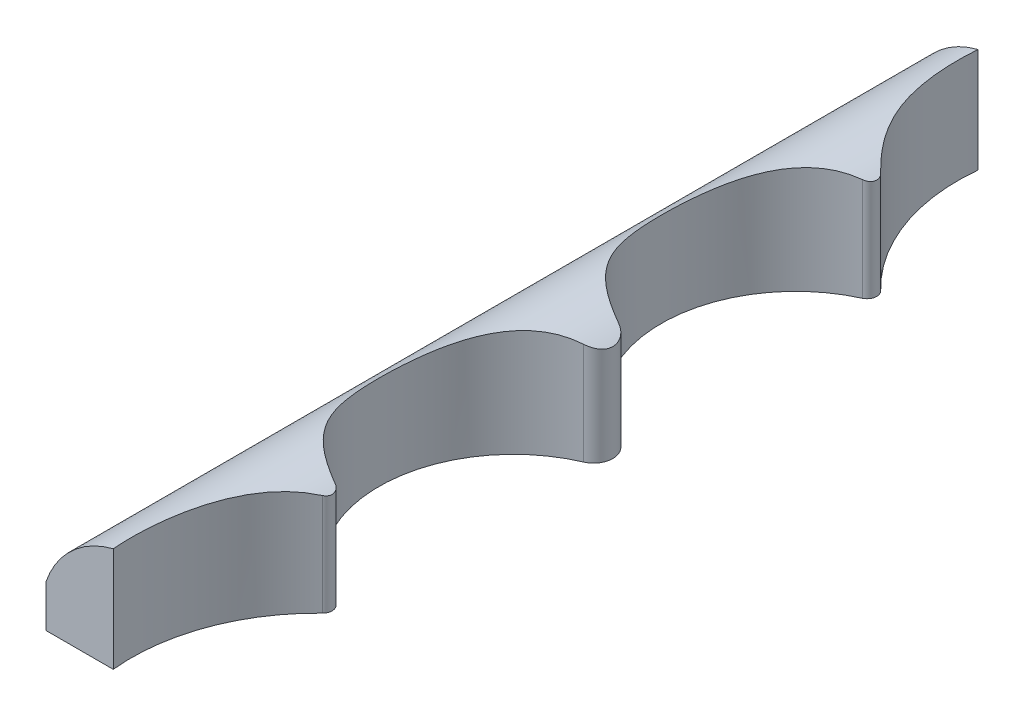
ISO-10303-21;
HEADER;
FILE_DESCRIPTION(('STEP AP214'),'2;1');
FILE_NAME('part.step','',(''),(''),'','','');
FILE_SCHEMA(('AUTOMOTIVE_DESIGN { 1 0 10303 214 1 1 1 1 }'));
ENDSEC;
DATA;
#1=APPLICATION_CONTEXT('core data for automotive mechanical design processes');
#2=APPLICATION_PROTOCOL_DEFINITION('international standard','automotive_design',2000,#1);
#3=PRODUCT_CONTEXT('',#1,'mechanical');
#4=PRODUCT('Part','Part','',(#3));
#5=PRODUCT_RELATED_PRODUCT_CATEGORY('part','',(#4));
#6=PRODUCT_DEFINITION_FORMATION('','',#4);
#7=PRODUCT_DEFINITION_CONTEXT('part definition',#1,'design');
#8=PRODUCT_DEFINITION('design','',#6,#7);
#9=PRODUCT_DEFINITION_SHAPE('','',#8);
#10=(LENGTH_UNIT() NAMED_UNIT(*) SI_UNIT(.MILLI.,.METRE.));
#11=(NAMED_UNIT(*) PLANE_ANGLE_UNIT() SI_UNIT($,.RADIAN.));
#12=(NAMED_UNIT(*) SI_UNIT($,.STERADIAN.) SOLID_ANGLE_UNIT());
#13=UNCERTAINTY_MEASURE_WITH_UNIT(LENGTH_MEASURE(1.E-05),#10,'distance_accuracy_value','');
#14=(GEOMETRIC_REPRESENTATION_CONTEXT(3) GLOBAL_UNCERTAINTY_ASSIGNED_CONTEXT((#13)) GLOBAL_UNIT_ASSIGNED_CONTEXT((#10,
#11,#12)) REPRESENTATION_CONTEXT('',''));
#15=CARTESIAN_POINT('',(0.,0.,0.));
#16=DIRECTION('',(0.,0.,1.));
#17=DIRECTION('',(1.,0.,0.));
#18=AXIS2_PLACEMENT_3D('',#15,#16,#17);
#19=CARTESIAN_POINT('',(-40.,35.,235.));
#20=DIRECTION('',(1.,0.,0.));
#21=DIRECTION('',(0.,1.,0.));
#22=AXIS2_PLACEMENT_3D('',#19,#20,#21);
#23=PLANE('',#22);
#24=DIRECTION('',(0.,1.,0.));
#25=VECTOR('',#24,1.);
#26=CARTESIAN_POINT('',(-40.,-35.,225.));
#27=LINE('',#26,#25);
#28=CARTESIAN_POINT('',(-40.,-35.,225.));
#29=VERTEX_POINT('',#28);
#30=CARTESIAN_POINT('',(-40.,-13.,225.));
#31=VERTEX_POINT('',#30);
#32=EDGE_CURVE('E130',#29,#31,#27,.T.);
#33=ORIENTED_EDGE('',*,*,#32,.T.);
#34=DIRECTION('',(0.,0.,1.));
#35=VECTOR('',#34,1.);
#36=CARTESIAN_POINT('',(-40.,-13.,-225.));
#37=LINE('',#36,#35);
#38=CARTESIAN_POINT('',(-40.,-13.,-225.));
#39=VERTEX_POINT('',#38);
#40=EDGE_CURVE('E115',#39,#31,#37,.T.);
#41=ORIENTED_EDGE('',*,*,#40,.F.);
#42=DIRECTION('',(0.,1.,0.));
#43=VECTOR('',#42,1.);
#44=CARTESIAN_POINT('',(-40.,-35.,-225.));
#45=LINE('',#44,#43);
#46=CARTESIAN_POINT('',(-40.,-35.,-225.));
#47=VERTEX_POINT('',#46);
#48=EDGE_CURVE('E128',#47,#39,#45,.T.);
#49=ORIENTED_EDGE('',*,*,#48,.F.);
#50=DIRECTION('',(0.,0.,-1.));
#51=VECTOR('',#50,1.);
#52=CARTESIAN_POINT('',(-40.,-35.,235.));
#53=LINE('',#52,#51);
#54=EDGE_CURVE('E46',#29,#47,#53,.T.);
#55=ORIENTED_EDGE('',*,*,#54,.F.);
#56=EDGE_LOOP('',(#33,#41,#49,#55));
#57=FACE_BOUND('',#56,.T.);
#58=ADVANCED_FACE('F34',(#57),#23,.F.);
#59=CARTESIAN_POINT('',(-40.,-35.,235.));
#60=DIRECTION('',(0.,1.,0.));
#61=DIRECTION('',(0.,0.,1.));
#62=AXIS2_PLACEMENT_3D('',#59,#60,#61);
#63=PLANE('',#62);
#64=DIRECTION('',(1.,0.,0.));
#65=VECTOR('',#64,1.);
#66=CARTESIAN_POINT('',(-40.,-35.,-225.));
#67=LINE('',#66,#65);
#68=CARTESIAN_POINT('',(-5.,-35.,-225.));
#69=VERTEX_POINT('',#68);
#70=EDGE_CURVE('E133',#47,#69,#67,.T.);
#71=ORIENTED_EDGE('',*,*,#70,.T.);
#72=CARTESIAN_POINT('',(91.5078845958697,-35.,-215.032658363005));
#73=DIRECTION('',(0.,1.,0.));
#74=DIRECTION('',(0.,0.,1.));
#75=AXIS2_PLACEMENT_3D('',#72,#73,#74);
#76=CIRCLE('',#75,97.0212331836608);
#77=CARTESIAN_POINT('',(24.0654509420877,-35.,-145.285702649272));
#78=VERTEX_POINT('',#77);
#79=EDGE_CURVE('E181',#69,#78,#76,.T.);
#80=ORIENTED_EDGE('',*,*,#79,.T.);
#81=CARTESIAN_POINT('',(20.5897976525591,-35.,-141.691285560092));
#82=DIRECTION('',(0.,-1.,0.));
#83=DIRECTION('',(0.,0.,-1.));
#84=AXIS2_PLACEMENT_3D('',#81,#82,#83);
#85=CIRCLE('',#84,5.);
#86=CARTESIAN_POINT('',(22.6640725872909,-35.,-137.141847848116));
#87=VERTEX_POINT('',#86);
#88=EDGE_CURVE('E178',#78,#87,#85,.T.);
#89=ORIENTED_EDGE('',*,*,#88,.T.);
#90=CARTESIAN_POINT('',(51.703921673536,-35.,-73.4497198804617));
#91=DIRECTION('',(0.,1.,0.));
#92=DIRECTION('',(0.,0.,1.));
#93=AXIS2_PLACEMENT_3D('',#90,#91,#92);
#94=CIRCLE('',#93,70.);
#95=CARTESIAN_POINT('',(23.962990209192,-35.,-9.18121498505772));
#96=VERTEX_POINT('',#95);
#97=EDGE_CURVE('E175',#87,#96,#94,.T.);
#98=ORIENTED_EDGE('',*,*,#97,.T.);
#99=CARTESIAN_POINT('',(20.,-35.,0.));
#100=DIRECTION('',(0.,-1.,0.));
#101=DIRECTION('',(0.,0.,1.));
#102=AXIS2_PLACEMENT_3D('',#99,#100,#101);
#103=CIRCLE('',#102,10.);
#104=CARTESIAN_POINT('',(23.962990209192,-35.,9.18121498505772));
#105=VERTEX_POINT('',#104);
#106=EDGE_CURVE('E172',#96,#105,#103,.T.);
#107=ORIENTED_EDGE('',*,*,#106,.T.);
#108=CARTESIAN_POINT('',(51.703921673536,-35.,73.4497198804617));
#109=DIRECTION('',(0.,1.,0.));
#110=DIRECTION('',(0.,0.,-1.));
#111=AXIS2_PLACEMENT_3D('',#108,#109,#110);
#112=CIRCLE('',#111,70.);
#113=CARTESIAN_POINT('',(22.6640725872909,-35.,137.141847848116));
#114=VERTEX_POINT('',#113);
#115=EDGE_CURVE('E169',#105,#114,#112,.T.);
#116=ORIENTED_EDGE('',*,*,#115,.T.);
#117=CARTESIAN_POINT('',(20.5897976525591,-35.,141.691285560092));
#118=DIRECTION('',(0.,-1.,0.));
#119=DIRECTION('',(0.,0.,-1.));
#120=AXIS2_PLACEMENT_3D('',#117,#118,#119);
#121=CIRCLE('',#120,5.);
#122=CARTESIAN_POINT('',(24.0654509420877,-35.,145.285702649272));
#123=VERTEX_POINT('',#122);
#124=EDGE_CURVE('E166',#114,#123,#121,.T.);
#125=ORIENTED_EDGE('',*,*,#124,.T.);
#126=CARTESIAN_POINT('',(91.5078845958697,-35.,215.032658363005));
#127=DIRECTION('',(0.,1.,0.));
#128=DIRECTION('',(0.,0.,-1.));
#129=AXIS2_PLACEMENT_3D('',#126,#127,#128);
#130=CIRCLE('',#129,97.0212331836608);
#131=CARTESIAN_POINT('',(-5.,-35.,225.));
#132=VERTEX_POINT('',#131);
#133=EDGE_CURVE('E145',#123,#132,#130,.T.);
#134=ORIENTED_EDGE('',*,*,#133,.T.);
#135=DIRECTION('',(-1.,0.,0.));
#136=VECTOR('',#135,1.);
#137=CARTESIAN_POINT('',(-40.,-35.,225.));
#138=LINE('',#137,#136);
#139=EDGE_CURVE('E138',#132,#29,#138,.T.);
#140=ORIENTED_EDGE('',*,*,#139,.T.);
#141=ORIENTED_EDGE('',*,*,#54,.T.);
#142=EDGE_LOOP('',(#71,#80,#89,#98,#107,#116,#125,#134,#140,#141));
#143=FACE_BOUND('',#142,.T.);
#144=ADVANCED_FACE('F254',(#143),#63,.F.);
#145=CARTESIAN_POINT('',(-40.,-35.,-225.));
#146=DIRECTION('',(0.,0.,1.));
#147=DIRECTION('',(1.,0.,0.));
#148=AXIS2_PLACEMENT_3D('',#145,#146,#147);
#149=PLANE('',#148);
#150=ORIENTED_EDGE('',*,*,#48,.T.);
#151=CARTESIAN_POINT('',(7.3426064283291,-29.0834578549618,-225.));
#152=DIRECTION('',(0.,0.,-1.));
#153=DIRECTION('',(1.,0.,0.));
#154=AXIS2_PLACEMENT_3D('',#151,#152,#153);
#155=CIRCLE('',#154,50.);
#156=CARTESIAN_POINT('',(-5.,19.3692001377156,-225.));
#157=VERTEX_POINT('',#156);
#158=EDGE_CURVE('E112',#39,#157,#155,.T.);
#159=ORIENTED_EDGE('',*,*,#158,.T.);
#160=DIRECTION('',(0.,1.,0.));
#161=VECTOR('',#160,1.);
#162=CARTESIAN_POINT('',(-5.,-35.,-225.));
#163=LINE('',#162,#161);
#164=EDGE_CURVE('E140',#69,#157,#163,.T.);
#165=ORIENTED_EDGE('',*,*,#164,.F.);
#166=ORIENTED_EDGE('',*,*,#70,.F.);
#167=EDGE_LOOP('',(#150,#159,#165,#166));
#168=FACE_BOUND('',#167,.T.);
#169=ADVANCED_FACE('F132',(#168),#149,.F.);
#170=CARTESIAN_POINT('',(-40.,-35.,225.));
#171=DIRECTION('',(0.,0.,-1.));
#172=DIRECTION('',(-1.,0.,0.));
#173=AXIS2_PLACEMENT_3D('',#170,#171,#172);
#174=PLANE('',#173);
#175=DIRECTION('',(0.,1.,0.));
#176=VECTOR('',#175,1.);
#177=CARTESIAN_POINT('',(-5.,-35.,225.));
#178=LINE('',#177,#176);
#179=CARTESIAN_POINT('',(-5.,19.3692001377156,225.));
#180=VERTEX_POINT('',#179);
#181=EDGE_CURVE('E160',#132,#180,#178,.T.);
#182=ORIENTED_EDGE('',*,*,#181,.T.);
#183=CARTESIAN_POINT('',(7.3426064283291,-29.0834578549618,225.));
#184=DIRECTION('',(0.,0.,-1.));
#185=DIRECTION('',(1.,0.,0.));
#186=AXIS2_PLACEMENT_3D('',#183,#184,#185);
#187=CIRCLE('',#186,50.);
#188=EDGE_CURVE('E123',#31,#180,#187,.T.);
#189=ORIENTED_EDGE('',*,*,#188,.F.);
#190=ORIENTED_EDGE('',*,*,#32,.F.);
#191=ORIENTED_EDGE('',*,*,#139,.F.);
#192=EDGE_LOOP('',(#182,#189,#190,#191));
#193=FACE_BOUND('',#192,.T.);
#194=ADVANCED_FACE('F261',(#193),#174,.F.);
#195=CARTESIAN_POINT('',(91.5078845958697,-35.,-215.032658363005));
#196=DIRECTION('',(0.,1.,0.));
#197=DIRECTION('',(0.,0.,1.));
#198=AXIS2_PLACEMENT_3D('',#195,#196,#197);
#199=CYLINDRICAL_SURFACE('',#198,97.0212331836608);
#200=ORIENTED_EDGE('',*,*,#164,.T.);
#201=CARTESIAN_POINT('',(-5.,19.3692001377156,-225.));
#202=CARTESIAN_POINT('',(-5.06801534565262,19.3518696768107,-224.341447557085));
#203=CARTESIAN_POINT('',(-5.12929186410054,19.3361130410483,-223.682177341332));
#204=CARTESIAN_POINT('',(-5.23834125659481,19.3078947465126,-222.362453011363));
#205=CARTESIAN_POINT('',(-5.28611417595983,19.2954330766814,-221.701998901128));
#206=CARTESIAN_POINT('',(-5.40913467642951,19.2632125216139,-219.719303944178));
#207=CARTESIAN_POINT('',(-5.46409145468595,19.2486161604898,-218.395658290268));
#208=CARTESIAN_POINT('',(-5.51975125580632,19.2338322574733,-215.747566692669));
#209=CARTESIAN_POINT('',(-5.52046977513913,19.2336405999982,-214.423121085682));
#210=CARTESIAN_POINT('',(-5.46769527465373,19.2476597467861,-211.77538135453));
#211=CARTESIAN_POINT('',(-5.41420245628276,19.2618704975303,-210.452087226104));
#212=CARTESIAN_POINT('',(-5.25301142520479,19.3041164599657,-207.807263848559));
#213=CARTESIAN_POINT('',(-5.14524117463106,19.3321700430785,-206.485739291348));
#214=CARTESIAN_POINT('',(-4.87568264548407,19.4008977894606,-203.848538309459));
#215=CARTESIAN_POINT('',(-4.71389409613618,19.4415720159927,-202.532861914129));
#216=CARTESIAN_POINT('',(-4.33661624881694,19.5337556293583,-199.909583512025));
#217=CARTESIAN_POINT('',(-4.12112551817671,19.5852653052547,-198.60198172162));
#218=CARTESIAN_POINT('',(-3.63685037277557,19.6967968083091,-195.997056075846));
#219=CARTESIAN_POINT('',(-3.36806593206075,19.7568186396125,-194.699732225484));
#220=CARTESIAN_POINT('',(-2.77619921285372,19.882875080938,-192.110986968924));
#221=CARTESIAN_POINT('',(-2.45285219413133,19.94893825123,-190.81962749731));
#222=CARTESIAN_POINT('',(-1.75334132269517,20.0835083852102,-188.2514205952));
#223=CARTESIAN_POINT('',(-1.3771772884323,20.1520153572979,-186.974573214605));
#224=CARTESIAN_POINT('',(-0.57258526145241,20.2877502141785,-184.437262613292));
#225=CARTESIAN_POINT('',(-0.144152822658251,20.3549779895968,-183.176800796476));
#226=CARTESIAN_POINT('',(0.764307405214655,20.4840361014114,-180.674329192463));
#227=CARTESIAN_POINT('',(1.24433494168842,20.5458664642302,-179.432319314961));
#228=CARTESIAN_POINT('',(2.25335180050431,20.6594436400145,-176.97339618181));
#229=CARTESIAN_POINT('',(2.78214803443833,20.7112278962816,-175.756405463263));
#230=CARTESIAN_POINT('',(3.88944435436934,20.8002486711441,-173.344659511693));
#231=CARTESIAN_POINT('',(4.46794528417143,20.8374849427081,-172.149904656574));
#232=CARTESIAN_POINT('',(5.67361409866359,20.8923220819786,-169.784904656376));
#233=CARTESIAN_POINT('',(6.30077625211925,20.9099252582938,-168.614656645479));
#234=CARTESIAN_POINT('',(7.60264195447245,20.9201029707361,-166.30082299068));
#235=CARTESIAN_POINT('',(8.27734245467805,20.9126791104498,-165.157235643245));
#236=CARTESIAN_POINT('',(9.50633642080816,20.8725301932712,-163.168535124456));
#237=CARTESIAN_POINT('',(10.0509581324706,20.8462632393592,-162.317298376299));
#238=CARTESIAN_POINT('',(11.166097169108,20.773268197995,-160.63287032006));
#239=CARTESIAN_POINT('',(11.7366133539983,20.7265410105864,-159.799678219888));
#240=CARTESIAN_POINT('',(12.9022882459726,20.6099305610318,-158.152987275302));
#241=CARTESIAN_POINT('',(13.4974342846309,20.5400590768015,-157.339478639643));
#242=CARTESIAN_POINT('',(14.7113976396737,20.3743641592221,-155.733142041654));
#243=CARTESIAN_POINT('',(15.330212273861,20.2785436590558,-154.940311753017));
#244=CARTESIAN_POINT('',(16.5948207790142,20.0572747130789,-153.370874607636));
#245=CARTESIAN_POINT('',(17.2407803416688,19.9316123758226,-152.594431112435));
#246=CARTESIAN_POINT('',(18.5535461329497,19.6481103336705,-151.065483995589));
#247=CARTESIAN_POINT('',(19.2203508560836,19.4902729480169,-150.31297865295));
#248=CARTESIAN_POINT('',(20.5741017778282,19.1391236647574,-148.832006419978));
#249=CARTESIAN_POINT('',(21.2610840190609,18.9457445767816,-148.103588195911));
#250=CARTESIAN_POINT('',(22.3038893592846,18.6270462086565,-147.031367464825));
#251=CARTESIAN_POINT('',(22.6536061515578,18.5160207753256,-146.677303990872));
#252=CARTESIAN_POINT('',(23.3567968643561,18.2840707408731,-145.976192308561));
#253=CARTESIAN_POINT('',(23.7102709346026,18.1631457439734,-145.629144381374));
#254=CARTESIAN_POINT('',(24.0654509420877,18.0370946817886,-145.285702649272));
#255=B_SPLINE_CURVE_WITH_KNOTS('',3,(#201,#202,#203,#204,#205,#206,#207,#208,#209,#210,#211,
#212,#213,#214,#215,#216,#217,#218,#219,#220,#221,#222,#223,#224,#225,#226,#227,#228,#229,#230,
#231,#232,#233,#234,#235,#236,#237,#238,#239,#240,#241,#242,#243,#244,#245,#246,#247,#248,#249,
#250,#251,#252,#253,#254),.UNSPECIFIED.,.F.,.F.,(4,2,2,2,2,2,2,2,2,2,2,2,2,2,2,2,2,2,2,2,2,2,2,
2,2,2,4),(0.,1.9867706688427,3.97353466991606,7.94684507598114,11.9190202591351,
15.8911806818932,19.8686269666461,23.8460931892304,27.823665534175,31.8012398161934,
35.7986997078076,39.7961733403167,43.7939872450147,47.7917815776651,51.7743765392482,
55.7570391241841,59.7392333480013,63.7211724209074,66.7532144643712,69.7851231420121,
72.8154912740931,75.845517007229,78.8979533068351,81.9501696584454,85.0082166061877,
86.5377531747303,88.0673509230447),.UNSPECIFIED.);
#256=CARTESIAN_POINT('',(24.0654509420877,18.0370946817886,-145.285702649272));
#257=VERTEX_POINT('',#256);
#258=EDGE_CURVE('E118',#157,#257,#255,.T.);
#259=ORIENTED_EDGE('',*,*,#258,.T.);
#260=DIRECTION('',(0.,1.,0.));
#261=VECTOR('',#260,1.);
#262=CARTESIAN_POINT('',(24.0654509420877,-35.,-145.285702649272));
#263=LINE('',#262,#261);
#264=EDGE_CURVE('E141',#78,#257,#263,.T.);
#265=ORIENTED_EDGE('',*,*,#264,.F.);
#266=ORIENTED_EDGE('',*,*,#79,.F.);
#267=EDGE_LOOP('',(#200,#259,#265,#266));
#268=FACE_BOUND('',#267,.T.);
#269=ADVANCED_FACE('F195',(#268),#199,.F.);
#270=CARTESIAN_POINT('',(91.5078845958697,-35.,215.032658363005));
#271=DIRECTION('',(0.,1.,0.));
#272=DIRECTION('',(0.,0.,1.));
#273=AXIS2_PLACEMENT_3D('',#270,#271,#272);
#274=CYLINDRICAL_SURFACE('',#273,97.0212331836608);
#275=DIRECTION('',(0.,1.,0.));
#276=VECTOR('',#275,1.);
#277=CARTESIAN_POINT('',(24.0654509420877,-35.,145.285702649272));
#278=LINE('',#277,#276);
#279=CARTESIAN_POINT('',(24.0654509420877,18.0370946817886,145.285702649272));
#280=VERTEX_POINT('',#279);
#281=EDGE_CURVE('E157',#123,#280,#278,.T.);
#282=ORIENTED_EDGE('',*,*,#281,.T.);
#283=CARTESIAN_POINT('',(24.0654509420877,18.0370946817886,145.285702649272));
#284=CARTESIAN_POINT('',(23.6921804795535,18.1695658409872,145.646636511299));
#285=CARTESIAN_POINT('',(23.3207956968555,18.2963750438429,146.011552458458));
#286=CARTESIAN_POINT('',(22.5821976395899,18.5390785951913,146.749119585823));
#287=CARTESIAN_POINT('',(22.2149841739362,18.6549734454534,147.121770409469));
#288=CARTESIAN_POINT('',(21.1204280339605,18.9868330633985,148.250745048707));
#289=CARTESIAN_POINT('',(20.3998843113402,19.1870733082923,149.018366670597));
#290=CARTESIAN_POINT('',(18.9814504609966,19.548547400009,150.579988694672));
#291=CARTESIAN_POINT('',(18.2835157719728,19.7098626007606,151.373930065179));
#292=CARTESIAN_POINT('',(16.9109720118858,19.9974759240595,152.987975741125));
#293=CARTESIAN_POINT('',(16.2363648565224,20.1237711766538,153.808082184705));
#294=CARTESIAN_POINT('',(14.9175520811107,20.3439004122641,155.466271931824));
#295=CARTESIAN_POINT('',(14.273154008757,20.4379743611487,156.304170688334));
#296=CARTESIAN_POINT('',(13.0108229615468,20.5982910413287,158.002398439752));
#297=CARTESIAN_POINT('',(12.3928932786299,20.6645303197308,158.862730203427));
#298=CARTESIAN_POINT('',(11.184514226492,20.7724137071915,160.604722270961));
#299=CARTESIAN_POINT('',(10.5940814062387,20.8140431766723,161.486394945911));
#300=CARTESIAN_POINT('',(9.44219600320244,20.8757690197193,163.269074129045));
#301=CARTESIAN_POINT('',(8.88074116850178,20.8958670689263,164.170079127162));
#302=CARTESIAN_POINT('',(7.65549011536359,20.9201719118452,166.210193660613));
#303=CARTESIAN_POINT('',(6.99975883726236,20.9193634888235,167.354215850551));
#304=CARTESIAN_POINT('',(5.7355577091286,20.8947085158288,169.667851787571));
#305=CARTESIAN_POINT('',(5.1270902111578,20.8708608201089,170.837466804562));
#306=CARTESIAN_POINT('',(3.95847633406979,20.8053201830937,173.200160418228));
#307=CARTESIAN_POINT('',(3.39833250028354,20.7636263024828,174.393240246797));
#308=CARTESIAN_POINT('',(2.32729832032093,20.6672786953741,176.800753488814));
#309=CARTESIAN_POINT('',(1.81640730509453,20.6126251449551,178.015186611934));
#310=CARTESIAN_POINT('',(0.842971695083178,20.4947222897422,180.467651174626));
#311=CARTESIAN_POINT('',(0.380597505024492,20.4314443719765,181.705748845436));
#312=CARTESIAN_POINT('',(-0.493136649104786,20.3007123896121,184.199600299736));
#313=CARTESIAN_POINT('',(-0.904496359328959,20.2332583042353,185.455354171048));
#314=CARTESIAN_POINT('',(-1.67555615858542,20.09810318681,187.982498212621));
#315=CARTESIAN_POINT('',(-2.03526040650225,20.0304021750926,189.253887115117));
#316=CARTESIAN_POINT('',(-2.70248617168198,19.8982918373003,191.810449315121));
#317=CARTESIAN_POINT('',(-3.01000808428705,19.8338824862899,193.095622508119));
#318=CARTESIAN_POINT('',(-3.56411746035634,19.7132775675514,195.639897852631));
#319=CARTESIAN_POINT('',(-3.81222690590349,19.6568965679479,196.898659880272));
#320=CARTESIAN_POINT('',(-4.25838419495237,19.552634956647,199.425376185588));
#321=CARTESIAN_POINT('',(-4.45643226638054,19.5047543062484,200.693330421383));
#322=CARTESIAN_POINT('',(-4.80210705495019,19.4195073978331,203.236396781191));
#323=CARTESIAN_POINT('',(-4.94973583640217,19.3821407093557,204.511508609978));
#324=CARTESIAN_POINT('',(-5.19430481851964,19.3194532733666,207.066877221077));
#325=CARTESIAN_POINT('',(-5.29124524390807,19.2941324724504,208.347133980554));
#326=CARTESIAN_POINT('',(-5.43417326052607,19.2565810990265,210.909346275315));
#327=CARTESIAN_POINT('',(-5.48021386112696,19.2443369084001,212.191298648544));
#328=CARTESIAN_POINT('',(-5.52143156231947,19.2333815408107,214.756073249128));
#329=CARTESIAN_POINT('',(-5.5166084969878,19.2346704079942,216.038895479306));
#330=CARTESIAN_POINT('',(-5.45609580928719,19.2507355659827,218.603636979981));
#331=CARTESIAN_POINT('',(-5.40039256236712,19.2655154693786,219.885555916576));
#332=CARTESIAN_POINT('',(-5.27876707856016,19.2973500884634,221.805782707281));
#333=CARTESIAN_POINT('',(-5.23187848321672,19.3095728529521,222.445432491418));
#334=CARTESIAN_POINT('',(-5.12543390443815,19.3371051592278,223.723612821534));
#335=CARTESIAN_POINT('',(-5.06587788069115,19.3524147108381,224.362143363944));
#336=CARTESIAN_POINT('',(-5.00000000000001,19.3692001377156,225.));
#337=B_SPLINE_CURVE_WITH_KNOTS('',3,(#283,#284,#285,#286,#287,#288,#289,#290,#291,#292,#293,
#294,#295,#296,#297,#298,#299,#300,#301,#302,#303,#304,#305,#306,#307,#308,#309,#310,#311,#312,
#313,#314,#315,#316,#317,#318,#319,#320,#321,#322,#323,#324,#325,#326,#327,#328,#329,#330,#331,
#332,#333,#334,#335,#336),.UNSPECIFIED.,.F.,.F.,(4,2,2,2,2,2,2,2,2,2,2,2,2,2,2,2,2,2,2,2,2,2,2,
2,2,2,4),(0.,1.607493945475,3.21491395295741,6.42852780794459,9.63536582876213,12.8424665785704,
16.0251350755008,19.2081982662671,22.3931530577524,25.5778599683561,29.5323347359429,
33.4870061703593,37.4418857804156,41.3967116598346,45.3649931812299,49.3332944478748,
53.3012760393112,57.2692275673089,61.120861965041,64.9724788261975,68.8239379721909,
72.6753800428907,76.5228072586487,80.3702470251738,84.2187173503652,86.1430497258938,
88.0673882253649),.UNSPECIFIED.);
#338=EDGE_CURVE('E189',#280,#180,#337,.T.);
#339=ORIENTED_EDGE('',*,*,#338,.T.);
#340=ORIENTED_EDGE('',*,*,#181,.F.);
#341=ORIENTED_EDGE('',*,*,#133,.F.);
#342=EDGE_LOOP('',(#282,#339,#340,#341));
#343=FACE_BOUND('',#342,.T.);
#344=ADVANCED_FACE('F201',(#343),#274,.F.);
#345=CARTESIAN_POINT('',(20.5897976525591,-35.,141.691285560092));
#346=DIRECTION('',(0.,1.,0.));
#347=DIRECTION('',(0.,0.,1.));
#348=AXIS2_PLACEMENT_3D('',#345,#346,#347);
#349=CYLINDRICAL_SURFACE('',#348,5.);
#350=DIRECTION('',(0.,1.,0.));
#351=VECTOR('',#350,1.);
#352=CARTESIAN_POINT('',(22.6640725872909,-35.,137.141847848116));
#353=LINE('',#352,#351);
#354=CARTESIAN_POINT('',(22.6640725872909,18.5112127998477,137.141847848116));
#355=VERTEX_POINT('',#354);
#356=EDGE_CURVE('E154',#114,#355,#353,.T.);
#357=ORIENTED_EDGE('',*,*,#356,.T.);
#358=CARTESIAN_POINT('',(22.6640725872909,18.5112127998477,137.141847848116));
#359=CARTESIAN_POINT('',(22.7938839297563,18.4694288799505,137.201024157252));
#360=CARTESIAN_POINT('',(22.921213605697,18.4278490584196,137.265799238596));
#361=CARTESIAN_POINT('',(23.1700886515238,18.3455193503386,137.406138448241));
#362=CARTESIAN_POINT('',(23.2916331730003,18.3047695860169,137.481704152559));
#363=CARTESIAN_POINT('',(23.5283062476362,18.2244569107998,137.643354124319));
#364=CARTESIAN_POINT('',(23.6434219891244,18.1848964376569,137.729458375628));
#365=CARTESIAN_POINT('',(23.8661469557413,18.1074999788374,137.911573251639));
#366=CARTESIAN_POINT('',(23.9737565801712,18.0696639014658,138.007583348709));
#367=CARTESIAN_POINT('',(24.1807942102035,17.996129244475,138.209096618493));
#368=CARTESIAN_POINT('',(24.280210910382,17.9604336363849,138.314612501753));
#369=CARTESIAN_POINT('',(24.4699192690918,17.8916987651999,138.534429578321));
#370=CARTESIAN_POINT('',(24.560207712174,17.8586604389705,138.648733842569));
#371=CARTESIAN_POINT('',(24.7307278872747,17.7957644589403,138.885234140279));
#372=CARTESIAN_POINT('',(24.810970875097,17.7659032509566,139.00742110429));
#373=CARTESIAN_POINT('',(24.9607538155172,17.7097818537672,139.25896856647));
#374=CARTESIAN_POINT('',(25.030294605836,17.6835213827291,139.388328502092));
#375=CARTESIAN_POINT('',(25.1553757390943,17.6360192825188,139.647905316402));
#376=CARTESIAN_POINT('',(25.2113698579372,17.6146171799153,139.777874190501));
#377=CARTESIAN_POINT('',(25.3122760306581,17.5758809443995,140.042574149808));
#378=CARTESIAN_POINT('',(25.3571927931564,17.5585450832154,140.17730318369));
#379=CARTESIAN_POINT('',(25.4355014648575,17.528224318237,140.450575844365));
#380=CARTESIAN_POINT('',(25.4688914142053,17.5152401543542,140.589120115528));
#381=CARTESIAN_POINT('',(25.5237606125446,17.4938596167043,140.868894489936));
#382=CARTESIAN_POINT('',(25.5452404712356,17.4854630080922,141.010124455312));
#383=CARTESIAN_POINT('',(25.5750937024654,17.4737826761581,141.285346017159));
#384=CARTESIAN_POINT('',(25.5841931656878,17.4702157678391,141.41924736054));
#385=CARTESIAN_POINT('',(25.5915958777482,17.4673144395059,141.687441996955));
#386=CARTESIAN_POINT('',(25.5898954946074,17.4679814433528,141.821735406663));
#387=CARTESIAN_POINT('',(25.5757128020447,17.4735382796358,142.089555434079));
#388=CARTESIAN_POINT('',(25.5632390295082,17.4784247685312,142.22308257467));
#389=CARTESIAN_POINT('',(25.5276437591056,17.4923382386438,142.48854099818));
#390=CARTESIAN_POINT('',(25.5045183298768,17.5013667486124,142.620471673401));
#391=CARTESIAN_POINT('',(25.448491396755,17.5231705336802,142.878790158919));
#392=CARTESIAN_POINT('',(25.4158217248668,17.5358568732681,143.005235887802));
#393=CARTESIAN_POINT('',(25.3408252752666,17.5648618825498,143.254848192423));
#394=CARTESIAN_POINT('',(25.2984950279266,17.5811818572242,143.378013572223));
#395=CARTESIAN_POINT('',(25.2045443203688,17.6172241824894,143.620272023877));
#396=CARTESIAN_POINT('',(25.152921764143,17.6369473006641,143.739364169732));
#397=CARTESIAN_POINT('',(25.0408357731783,17.6795219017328,143.972742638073));
#398=CARTESIAN_POINT('',(24.980369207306,17.7023744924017,144.087027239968));
#399=CARTESIAN_POINT('',(24.799030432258,17.7704509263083,144.399856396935));
#400=CARTESIAN_POINT('',(24.6686507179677,17.8188998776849,144.59234604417));
#401=CARTESIAN_POINT('',(24.4552303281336,17.8970043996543,144.864891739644));
#402=CARTESIAN_POINT('',(24.3811694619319,17.923924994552,144.952989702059));
#403=CARTESIAN_POINT('',(24.2274345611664,17.9793646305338,145.123595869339));
#404=CARTESIAN_POINT('',(24.1477610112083,18.0078835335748,145.206104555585));
#405=CARTESIAN_POINT('',(24.0654509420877,18.0370946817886,145.285702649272));
#406=B_SPLINE_CURVE_WITH_KNOTS('',3,(#358,#359,#360,#361,#362,#363,#364,#365,#366,#367,#368,
#369,#370,#371,#372,#373,#374,#375,#376,#377,#378,#379,#380,#381,#382,#383,#384,#385,#386,#387,
#388,#389,#390,#391,#392,#393,#394,#395,#396,#397,#398,#399,#400,#401,#402,#403,#404,#405),
.UNSPECIFIED.,.F.,.F.,(4,2,2,2,2,2,2,2,2,2,2,2,2,2,2,2,2,2,2,2,2,2,2,4),(0.,0.445850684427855,
0.891766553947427,1.33854149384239,1.78529264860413,2.23265029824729,2.68016498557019,
3.1271736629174,3.57414733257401,4.00297462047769,4.43161931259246,4.86033684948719,
5.28903243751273,5.69131063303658,6.09372412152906,6.49581902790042,6.89806246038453,
7.2912493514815,7.68457767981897,8.07799484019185,8.47155162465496,9.18122926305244,
9.53560364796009,9.88994747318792),.UNSPECIFIED.);
#407=EDGE_CURVE('E227',#355,#280,#406,.T.);
#408=ORIENTED_EDGE('',*,*,#407,.T.);
#409=ORIENTED_EDGE('',*,*,#281,.F.);
#410=ORIENTED_EDGE('',*,*,#124,.F.);
#411=EDGE_LOOP('',(#357,#408,#409,#410));
#412=FACE_BOUND('',#411,.T.);
#413=ADVANCED_FACE('F232',(#412),#349,.T.);
#414=CARTESIAN_POINT('',(51.703921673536,-35.,73.4497198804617));
#415=DIRECTION('',(0.,1.,0.));
#416=DIRECTION('',(0.,0.,1.));
#417=AXIS2_PLACEMENT_3D('',#414,#415,#416);
#418=CYLINDRICAL_SURFACE('',#417,70.);
#419=DIRECTION('',(0.,1.,0.));
#420=VECTOR('',#419,1.);
#421=CARTESIAN_POINT('',(23.962990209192,-35.,9.18121498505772));
#422=LINE('',#421,#420);
#423=CARTESIAN_POINT('',(23.962990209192,18.0733321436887,9.18121498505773));
#424=VERTEX_POINT('',#423);
#425=EDGE_CURVE('E151',#105,#424,#422,.T.);
#426=ORIENTED_EDGE('',*,*,#425,.T.);
#427=CARTESIAN_POINT('',(23.962990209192,18.0733321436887,9.18121498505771));
#428=CARTESIAN_POINT('',(23.3511500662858,18.2889991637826,9.44528050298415));
#429=CARTESIAN_POINT('',(22.7391519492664,18.4912874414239,9.71983742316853));
#430=CARTESIAN_POINT('',(21.5167891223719,18.8696568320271,10.289679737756));
#431=CARTESIAN_POINT('',(20.9064242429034,19.045740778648,10.5849628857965));
#432=CARTESIAN_POINT('',(19.6898203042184,19.3721168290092,11.1957210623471));
#433=CARTESIAN_POINT('',(19.0835774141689,19.5224373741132,11.5111732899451));
#434=CARTESIAN_POINT('',(17.8762704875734,19.7982904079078,12.1621982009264));
#435=CARTESIAN_POINT('',(17.2752065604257,19.9238223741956,12.4977713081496));
#436=CARTESIAN_POINT('',(16.0855664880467,20.1499026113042,13.1852999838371));
#437=CARTESIAN_POINT('',(15.4969259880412,20.2506762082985,13.5370703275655));
#438=CARTESIAN_POINT('',(14.3277393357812,20.4297498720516,14.2594059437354));
#439=CARTESIAN_POINT('',(13.7471940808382,20.5080474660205,14.6299732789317));
#440=CARTESIAN_POINT('',(12.5955160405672,20.6432262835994,15.3893345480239));
#441=CARTESIAN_POINT('',(12.024384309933,20.7001051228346,15.7781305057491));
#442=CARTESIAN_POINT('',(10.8927647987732,20.7935793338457,16.573292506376));
#443=CARTESIAN_POINT('',(10.3322781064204,20.8301726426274,16.9796603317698));
#444=CARTESIAN_POINT('',(8.67319973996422,20.911058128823,18.2205828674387));
#445=CARTESIAN_POINT('',(7.59184311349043,20.92703620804,19.0803492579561));
#446=CARTESIAN_POINT('',(5.48283465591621,20.8930781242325,20.8615325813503));
#447=CARTESIAN_POINT('',(4.45517936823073,20.8431462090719,21.7829455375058));
#448=CARTESIAN_POINT('',(2.45574818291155,20.6872825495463,23.6850136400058));
#449=CARTESIAN_POINT('',(1.4841238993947,20.5812061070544,24.6658160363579));
#450=CARTESIAN_POINT('',(-0.396698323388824,20.3230656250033,26.6798058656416));
#451=CARTESIAN_POINT('',(-1.30588728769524,20.1709949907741,27.7130007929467));
#452=CARTESIAN_POINT('',(-3.43403039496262,19.7580117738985,30.2797130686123));
#453=CARTESIAN_POINT('',(-4.61926602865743,19.4783603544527,31.8383092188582));
#454=CARTESIAN_POINT('',(-6.85172298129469,18.8733910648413,35.0432957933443));
#455=CARTESIAN_POINT('',(-7.89889723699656,18.5480576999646,36.6897158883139));
#456=CARTESIAN_POINT('',(-9.85219046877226,17.8782948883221,40.0633523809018));
#457=CARTESIAN_POINT('',(-10.758121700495,17.533840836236,41.7906724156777));
#458=CARTESIAN_POINT('',(-12.4233342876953,16.852554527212,45.3162151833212));
#459=CARTESIAN_POINT('',(-13.1826276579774,16.51572164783,47.1144320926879));
#460=CARTESIAN_POINT('',(-14.2114966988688,16.0337863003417,49.8672942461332));
#461=CARTESIAN_POINT('',(-14.5374773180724,15.8762878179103,50.7990443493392));
#462=CARTESIAN_POINT('',(-15.1502245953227,15.5728912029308,52.677177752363));
#463=CARTESIAN_POINT('',(-15.4369955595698,15.4269917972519,53.6235594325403));
#464=CARTESIAN_POINT('',(-15.9706818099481,15.1497991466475,55.5296835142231));
#465=CARTESIAN_POINT('',(-16.2175941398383,15.0185069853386,56.4894269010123));
#466=CARTESIAN_POINT('',(-16.6708630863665,14.7733512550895,58.4206638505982));
#467=CARTESIAN_POINT('',(-16.877219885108,14.659487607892,59.3921573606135));
#468=CARTESIAN_POINT('',(-17.2482661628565,14.4519770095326,61.3427393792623));
#469=CARTESIAN_POINT('',(-17.4130561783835,14.3582813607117,62.3218035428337));
#470=CARTESIAN_POINT('',(-17.7010356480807,14.1929051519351,64.2878980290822));
#471=CARTESIAN_POINT('',(-17.8242249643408,14.1212246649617,65.2749283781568));
#472=CARTESIAN_POINT('',(-18.0285043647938,14.001583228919,67.2546506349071));
#473=CARTESIAN_POINT('',(-18.1095997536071,13.9536192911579,68.2473418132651));
#474=CARTESIAN_POINT('',(-18.2293707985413,13.882562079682,70.2361603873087));
#475=CARTESIAN_POINT('',(-18.2680474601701,13.8594682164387,71.2322877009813));
#476=CARTESIAN_POINT('',(-18.3012672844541,13.8396362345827,73.1367199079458));
#477=CARTESIAN_POINT('',(-18.2994357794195,13.8407331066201,74.0449415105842));
#478=CARTESIAN_POINT('',(-18.260448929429,13.8639994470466,75.8603430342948));
#479=CARTESIAN_POINT('',(-18.2232942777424,13.8861685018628,76.7675229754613));
#480=CARTESIAN_POINT('',(-18.1137981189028,13.9511271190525,78.5789833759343));
#481=CARTESIAN_POINT('',(-18.041457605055,13.9939160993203,79.4832639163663));
#482=CARTESIAN_POINT('',(-17.8618434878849,14.0992531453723,81.287190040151));
#483=CARTESIAN_POINT('',(-17.754569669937,14.1618013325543,82.1868355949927));
#484=CARTESIAN_POINT('',(-17.5052922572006,14.3055112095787,83.9809075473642));
#485=CARTESIAN_POINT('',(-17.3632469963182,14.3866952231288,84.8753263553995));
#486=CARTESIAN_POINT('',(-17.0449264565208,14.5660735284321,86.6563182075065));
#487=CARTESIAN_POINT('',(-16.8686511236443,14.6642678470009,87.5428912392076));
#488=CARTESIAN_POINT('',(-16.4823537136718,14.8758389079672,89.3067979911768));
#489=CARTESIAN_POINT('',(-16.2723326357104,14.9892152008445,90.1841319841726));
#490=CARTESIAN_POINT('',(-15.8190473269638,15.2291074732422,91.9283803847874));
#491=CARTESIAN_POINT('',(-15.5757799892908,15.3556246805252,92.7952938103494));
#492=CARTESIAN_POINT('',(-14.8137762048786,15.7430183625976,95.3226117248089));
#493=CARTESIAN_POINT('',(-14.250073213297,16.0189580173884,96.9673911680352));
#494=CARTESIAN_POINT('',(-13.0037463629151,16.5947274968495,100.20659326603));
#495=CARTESIAN_POINT('',(-12.3211240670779,16.894557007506,101.801016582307));
#496=CARTESIAN_POINT('',(-10.8395927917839,17.500320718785,104.934863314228));
#497=CARTESIAN_POINT('',(-10.0406175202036,17.806258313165,106.474254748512));
#498=CARTESIAN_POINT('',(-8.32946215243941,18.4055716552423,109.491366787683));
#499=CARTESIAN_POINT('',(-7.41728448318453,18.698947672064,110.969088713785));
#500=CARTESIAN_POINT('',(-5.51319099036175,19.2453990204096,113.811019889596));
#501=CARTESIAN_POINT('',(-4.52471037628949,19.4994556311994,115.17734122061));
#502=CARTESIAN_POINT('',(-2.44711938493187,19.9603284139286,117.840202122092));
#503=CARTESIAN_POINT('',(-1.3580094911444,20.1671448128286,119.136742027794));
#504=CARTESIAN_POINT('',(0.345431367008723,20.4278352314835,121.02092790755));
#505=CARTESIAN_POINT('',(0.923876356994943,20.506388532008,121.637930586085));
#506=CARTESIAN_POINT('',(2.10382196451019,20.6448831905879,122.851603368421));
#507=CARTESIAN_POINT('',(2.70531998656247,20.7048266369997,123.44827574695));
#508=CARTESIAN_POINT('',(3.93052753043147,20.803769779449,124.620234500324));
#509=CARTESIAN_POINT('',(4.55423810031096,20.8427684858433,125.195519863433));
#510=CARTESIAN_POINT('',(5.82274522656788,20.8974684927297,126.32351215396));
#511=CARTESIAN_POINT('',(6.46754104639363,20.9131706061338,126.876219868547));
#512=CARTESIAN_POINT('',(7.71636741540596,20.9186754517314,127.907860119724));
#513=CARTESIAN_POINT('',(8.31865641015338,20.9107381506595,128.388889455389));
#514=CARTESIAN_POINT('',(9.53832329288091,20.8720329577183,129.330448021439));
#515=CARTESIAN_POINT('',(10.1557005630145,20.8412659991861,129.790978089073));
#516=CARTESIAN_POINT('',(11.4040073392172,20.7552450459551,130.690514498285));
#517=CARTESIAN_POINT('',(12.0349326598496,20.699998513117,131.129527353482));
#518=CARTESIAN_POINT('',(13.3088696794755,20.563435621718,131.985253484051));
#519=CARTESIAN_POINT('',(13.9518798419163,20.4821225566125,132.40196956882));
#520=CARTESIAN_POINT('',(15.2560120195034,20.2908013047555,133.21717066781));
#521=CARTESIAN_POINT('',(15.9172585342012,20.1804629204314,133.615379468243));
#522=CARTESIAN_POINT('',(17.2483085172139,19.9301697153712,134.387415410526));
#523=CARTESIAN_POINT('',(17.9181116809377,19.7902159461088,134.761243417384));
#524=CARTESIAN_POINT('',(19.2651653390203,19.4791917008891,135.484484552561));
#525=CARTESIAN_POINT('',(19.9424263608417,19.3080698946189,135.833856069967));
#526=CARTESIAN_POINT('',(21.3009211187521,18.9338598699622,136.507105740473));
#527=CARTESIAN_POINT('',(21.9821555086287,18.7307662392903,136.830979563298));
#528=CARTESIAN_POINT('',(22.6640725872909,18.5112127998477,137.141847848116));
#529=B_SPLINE_CURVE_WITH_KNOTS('',3,(#427,#428,#429,#430,#431,#432,#433,#434,#435,#436,#437,
#438,#439,#440,#441,#442,#443,#444,#445,#446,#447,#448,#449,#450,#451,#452,#453,#454,#455,#456,
#457,#458,#459,#460,#461,#462,#463,#464,#465,#466,#467,#468,#469,#470,#471,#472,#473,#474,#475,
#476,#477,#478,#479,#480,#481,#482,#483,#484,#485,#486,#487,#488,#489,#490,#491,#492,#493,#494,
#495,#496,#497,#498,#499,#500,#501,#502,#503,#504,#505,#506,#507,#508,#509,#510,#511,#512,#513,
#514,#515,#516,#517,#518,#519,#520,#521,#522,#523,#524,#525,#526,#527,#528),.UNSPECIFIED.,.F.,
.F.,(4,2,2,2,2,2,2,2,2,2,2,2,2,2,2,2,2,2,2,2,2,2,2,2,2,2,2,2,2,2,2,2,2,2,2,2,2,2,2,2,2,2,2,2,2,
2,2,2,2,2,4),(0.,2.10102342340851,4.20181948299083,6.30028122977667,8.39878719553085,
10.4774213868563,12.5562841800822,14.635378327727,16.7146838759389,20.8547763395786,
24.9946019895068,29.1451493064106,33.2962920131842,39.2218986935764,45.1495201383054,
51.0849547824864,57.0199028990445,60.0179706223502,63.0157088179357,66.0136692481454,
69.011616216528,72.0022410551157,74.992875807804,77.9831335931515,80.9733204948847,
83.6970749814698,86.4207760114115,89.1444001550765,91.8680410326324,94.594961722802,
97.321886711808,100.048730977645,102.775830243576,108.051652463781,113.32740534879,
118.606175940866,123.884833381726,128.996507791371,134.108157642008,136.655702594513,
139.202961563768,141.750340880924,144.297631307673,146.609449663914,148.921173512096,
151.232193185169,153.542920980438,155.881167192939,158.21933040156,160.561379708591,
162.903825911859),.UNSPECIFIED.);
#530=EDGE_CURVE('E222',#424,#355,#529,.T.);
#531=ORIENTED_EDGE('',*,*,#530,.T.);
#532=ORIENTED_EDGE('',*,*,#356,.F.);
#533=ORIENTED_EDGE('',*,*,#115,.F.);
#534=EDGE_LOOP('',(#426,#531,#532,#533));
#535=FACE_BOUND('',#534,.T.);
#536=ADVANCED_FACE('F235',(#535),#418,.F.);
#537=CARTESIAN_POINT('',(20.,-35.,0.));
#538=DIRECTION('',(0.,1.,0.));
#539=DIRECTION('',(0.,0.,1.));
#540=AXIS2_PLACEMENT_3D('',#537,#538,#539);
#541=CYLINDRICAL_SURFACE('',#540,10.);
#542=DIRECTION('',(0.,1.,0.));
#543=VECTOR('',#542,1.);
#544=CARTESIAN_POINT('',(23.962990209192,-35.,-9.18121498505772));
#545=LINE('',#544,#543);
#546=CARTESIAN_POINT('',(23.962990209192,18.0733321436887,-9.18121498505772));
#547=VERTEX_POINT('',#546);
#548=EDGE_CURVE('E148',#96,#547,#545,.T.);
#549=ORIENTED_EDGE('',*,*,#548,.T.);
#550=CARTESIAN_POINT('',(23.962990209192,18.0733321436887,-9.18121498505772));
#551=CARTESIAN_POINT('',(24.2306555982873,17.9790124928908,-9.06569040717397));
#552=CARTESIAN_POINT('',(24.4930361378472,17.8839561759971,-8.93854040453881));
#553=CARTESIAN_POINT('',(25.0056587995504,17.6935757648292,-8.66187988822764));
#554=CARTESIAN_POINT('',(25.2558999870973,17.5982516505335,-8.51236765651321));
#555=CARTESIAN_POINT('',(25.7432923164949,17.4082993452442,-8.19145733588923));
#556=CARTESIAN_POINT('',(25.9804061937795,17.3136737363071,-8.0200011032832));
#557=CARTESIAN_POINT('',(26.43924424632,17.1267116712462,-7.65648711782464));
#558=CARTESIAN_POINT('',(26.6609688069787,17.0343751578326,-7.46442988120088));
#559=CARTESIAN_POINT('',(27.0877371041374,16.8532772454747,-7.06048271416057));
#560=CARTESIAN_POINT('',(27.2927595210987,16.7645204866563,-6.84856815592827));
#561=CARTESIAN_POINT('',(27.6842099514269,16.5921910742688,-6.40625683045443));
#562=CARTESIAN_POINT('',(27.8706387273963,16.50861820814,-6.17586082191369));
#563=CARTESIAN_POINT('',(28.2231133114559,16.3482700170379,-5.69810841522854));
#564=CARTESIAN_POINT('',(28.3891787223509,16.2714881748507,-5.45076869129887));
#565=CARTESIAN_POINT('',(28.6994876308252,16.1261980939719,-4.94045271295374));
#566=CARTESIAN_POINT('',(28.843732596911,16.0576892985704,-4.67747751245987));
#567=CARTESIAN_POINT('',(29.1023746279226,15.9335619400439,-4.150741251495));
#568=CARTESIAN_POINT('',(29.217877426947,15.8774803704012,-3.88763260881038));
#569=CARTESIAN_POINT('',(29.4263161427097,15.7754681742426,-3.35074056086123));
#570=CARTESIAN_POINT('',(29.5192552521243,15.7295361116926,-3.07695867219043));
#571=CARTESIAN_POINT('',(29.6813521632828,15.6489536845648,-2.52095834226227));
#572=CARTESIAN_POINT('',(29.7505214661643,15.6142978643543,-2.23874405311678));
#573=CARTESIAN_POINT('',(29.8641651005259,15.557145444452,-1.6681819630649));
#574=CARTESIAN_POINT('',(29.9086420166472,15.5346475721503,-1.37983480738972));
#575=CARTESIAN_POINT('',(29.9690206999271,15.5040558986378,-0.829100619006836));
#576=CARTESIAN_POINT('',(29.9873628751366,15.4947327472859,-0.567046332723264));
#577=CARTESIAN_POINT('',(30.0033568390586,15.4866047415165,-0.0421542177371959));
#578=CARTESIAN_POINT('',(30.001010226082,15.4877990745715,0.220683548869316));
#579=CARTESIAN_POINT('',(29.9756602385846,15.5006769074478,0.745047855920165));
#580=CARTESIAN_POINT('',(29.9526607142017,15.5123584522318,1.0065746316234));
#581=CARTESIAN_POINT('',(29.8862965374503,15.5459429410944,1.52636341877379));
#582=CARTESIAN_POINT('',(29.8429319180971,15.5678458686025,1.78462543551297));
#583=CARTESIAN_POINT('',(29.7385874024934,15.6202700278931,2.28529092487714));
#584=CARTESIAN_POINT('',(29.6784190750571,15.6503929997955,2.5279061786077));
#585=CARTESIAN_POINT('',(29.5404621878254,15.7190100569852,3.00694729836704));
#586=CARTESIAN_POINT('',(29.4626674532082,15.7575070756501,3.24337096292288));
#587=CARTESIAN_POINT('',(29.2902496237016,15.8421491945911,3.70847060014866));
#588=CARTESIAN_POINT('',(29.1956329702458,15.8882913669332,3.93714949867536));
#589=CARTESIAN_POINT('',(28.9903452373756,15.9874684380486,4.38572240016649));
#590=CARTESIAN_POINT('',(28.8796683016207,16.0405058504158,4.60561316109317));
#591=CARTESIAN_POINT('',(28.63645124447,16.1558092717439,5.04766345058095));
#592=CARTESIAN_POINT('',(28.5030272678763,16.218428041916,5.26924462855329));
#593=CARTESIAN_POINT('',(28.2202613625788,16.3494356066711,5.70033227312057));
#594=CARTESIAN_POINT('',(28.0709125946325,16.4178268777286,5.90983349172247));
#595=CARTESIAN_POINT('',(27.7572915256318,16.5593974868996,6.31587525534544));
#596=CARTESIAN_POINT('',(27.5930087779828,16.6325801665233,6.51240655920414));
#597=CARTESIAN_POINT('',(27.2506525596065,16.78270226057,6.89153756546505));
#598=CARTESIAN_POINT('',(27.0725778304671,16.85964201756,7.0741359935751));
#599=CARTESIAN_POINT('',(26.6742790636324,17.0288004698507,7.45258296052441));
#600=CARTESIAN_POINT('',(26.4518586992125,17.1215011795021,7.64591116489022));
#601=CARTESIAN_POINT('',(25.9914372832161,17.3092459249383,8.011814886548));
#602=CARTESIAN_POINT('',(25.7534335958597,17.4042903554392,8.18438687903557));
#603=CARTESIAN_POINT('',(25.2637037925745,17.5952646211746,8.50760772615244));
#604=CARTESIAN_POINT('',(25.0119920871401,17.6911934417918,8.6582790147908));
#605=CARTESIAN_POINT('',(24.4962984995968,17.8827744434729,8.93695926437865));
#606=CARTESIAN_POINT('',(24.2323192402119,17.9784266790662,9.06497304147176));
#607=CARTESIAN_POINT('',(23.962990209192,18.0733321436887,9.18121498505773));
#608=B_SPLINE_CURVE_WITH_KNOTS('',3,(#550,#551,#552,#553,#554,#555,#556,#557,#558,#559,#560,
#561,#562,#563,#564,#565,#566,#567,#568,#569,#570,#571,#572,#573,#574,#575,#576,#577,#578,#579,
#580,#581,#582,#583,#584,#585,#586,#587,#588,#589,#590,#591,#592,#593,#594,#595,#596,#597,#598,
#599,#600,#601,#602,#603,#604,#605,#606,#607),.UNSPECIFIED.,.F.,.F.,(4,2,2,2,2,2,2,2,2,2,2,2,2,
2,2,2,2,2,2,2,2,2,2,2,2,2,2,2,4),(0.,0.918955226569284,1.83798109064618,2.75949450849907,
3.68098484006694,4.60363356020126,5.52624442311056,6.44796004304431,7.36961360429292,
8.24671722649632,9.1236966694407,10.0002511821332,10.8767139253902,11.6642944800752,
12.4518141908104,13.2391871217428,14.0265587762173,14.781037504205,15.5357809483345,
16.2902360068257,17.0449668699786,17.8424931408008,18.6403633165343,19.4387959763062,
20.2373015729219,21.1629623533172,22.0887801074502,23.0136427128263,23.9383084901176),.UNSPECIFIED.);
#609=EDGE_CURVE('E215',#547,#424,#608,.T.);
#610=ORIENTED_EDGE('',*,*,#609,.T.);
#611=ORIENTED_EDGE('',*,*,#425,.F.);
#612=ORIENTED_EDGE('',*,*,#106,.F.);
#613=EDGE_LOOP('',(#549,#610,#611,#612));
#614=FACE_BOUND('',#613,.T.);
#615=ADVANCED_FACE('F239',(#614),#541,.T.);
#616=CARTESIAN_POINT('',(51.703921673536,-35.,-73.4497198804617));
#617=DIRECTION('',(0.,1.,0.));
#618=DIRECTION('',(0.,0.,1.));
#619=AXIS2_PLACEMENT_3D('',#616,#617,#618);
#620=CYLINDRICAL_SURFACE('',#619,70.);
#621=DIRECTION('',(0.,1.,0.));
#622=VECTOR('',#621,1.);
#623=CARTESIAN_POINT('',(22.6640725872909,-35.,-137.141847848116));
#624=LINE('',#623,#622);
#625=CARTESIAN_POINT('',(22.6640725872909,18.5112127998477,-137.141847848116));
#626=VERTEX_POINT('',#625);
#627=EDGE_CURVE('E144',#87,#626,#624,.T.);
#628=ORIENTED_EDGE('',*,*,#627,.T.);
#629=CARTESIAN_POINT('',(22.6640725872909,18.5112127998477,-137.141847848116));
#630=CARTESIAN_POINT('',(22.0419307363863,18.7115136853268,-136.858219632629));
#631=CARTESIAN_POINT('',(21.4203489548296,18.8981250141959,-136.563774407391));
#632=CARTESIAN_POINT('',(20.1802903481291,19.2446670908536,-135.953616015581));
#633=CARTESIAN_POINT('',(19.5618131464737,19.4046011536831,-135.637905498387));
#634=CARTESIAN_POINT('',(18.3305284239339,19.6983611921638,-134.98590141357));
#635=CARTESIAN_POINT('',(17.7177150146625,19.8322181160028,-134.649632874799));
#636=CARTESIAN_POINT('',(16.4987405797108,20.0749736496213,-133.956634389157));
#637=CARTESIAN_POINT('',(15.8925797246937,20.1838716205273,-133.599903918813));
#638=CARTESIAN_POINT('',(14.6939861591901,20.376853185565,-132.869856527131));
#639=CARTESIAN_POINT('',(14.1014788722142,20.4611522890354,-132.496718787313));
#640=CARTESIAN_POINT('',(12.9259584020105,20.6073566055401,-131.731462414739));
#641=CARTESIAN_POINT('',(12.3429462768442,20.6692593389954,-131.339341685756));
#642=CARTESIAN_POINT('',(11.1876768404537,20.7718503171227,-130.536746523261));
#643=CARTESIAN_POINT('',(10.6154209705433,20.8125357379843,-130.126269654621));
#644=CARTESIAN_POINT('',(9.48285410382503,20.8739348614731,-129.287683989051));
#645=CARTESIAN_POINT('',(8.92254432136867,20.894646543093,-128.859573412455));
#646=CARTESIAN_POINT('',(7.26625160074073,20.9286364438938,-127.553903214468));
#647=CARTESIAN_POINT('',(6.18933130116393,20.9142374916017,-126.651132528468));
#648=CARTESIAN_POINT('',(4.09358198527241,20.821898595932,-124.784173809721));
#649=CARTESIAN_POINT('',(3.07474964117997,20.7439622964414,-123.819989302));
#650=CARTESIAN_POINT('',(1.09742085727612,20.5349662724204,-121.833089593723));
#651=CARTESIAN_POINT('',(0.13905620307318,20.4037948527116,-120.810255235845));
#652=CARTESIAN_POINT('',(-1.71168039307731,20.0988528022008,-118.712623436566));
#653=CARTESIAN_POINT('',(-2.60404706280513,19.9250787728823,-117.637821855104));
#654=CARTESIAN_POINT('',(-4.47406791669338,19.5111935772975,-115.243681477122));
#655=CARTESIAN_POINT('',(-5.43839230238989,19.264775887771,-113.915010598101));
#656=CARTESIAN_POINT('',(-7.26906742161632,18.7433648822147,-111.197192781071));
#657=CARTESIAN_POINT('',(-8.13541023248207,18.4683692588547,-109.808040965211));
#658=CARTESIAN_POINT('',(-9.7684973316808,17.9054429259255,-106.973149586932));
#659=CARTESIAN_POINT('',(-10.5351456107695,17.6175001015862,-105.527357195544));
#660=CARTESIAN_POINT('',(-11.9656655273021,17.0444569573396,-102.584913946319));
#661=CARTESIAN_POINT('',(-12.6295270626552,16.7593569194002,-101.088258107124));
#662=CARTESIAN_POINT('',(-13.6093905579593,16.3167345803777,-98.6518717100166));
#663=CARTESIAN_POINT('',(-13.9589699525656,16.1534388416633,-97.7265484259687));
#664=CARTESIAN_POINT('',(-14.6190677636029,15.8366815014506,-95.8604399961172));
#665=CARTESIAN_POINT('',(-14.9295892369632,15.6832191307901,-94.9196560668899));
#666=CARTESIAN_POINT('',(-15.5109681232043,15.3892335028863,-93.023731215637));
#667=CARTESIAN_POINT('',(-15.7818186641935,15.2487124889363,-92.0685878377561));
#668=CARTESIAN_POINT('',(-16.283107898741,14.9836051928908,-90.1455600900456));
#669=CARTESIAN_POINT('',(-16.5135470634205,14.8590187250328,-89.177675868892));
#670=CARTESIAN_POINT('',(-16.9329808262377,14.6287033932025,-87.2324581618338));
#671=CARTESIAN_POINT('',(-17.1220445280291,14.5229431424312,-86.2551433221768));
#672=CARTESIAN_POINT('',(-17.4585827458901,14.3324198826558,-84.2913253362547));
#673=CARTESIAN_POINT('',(-17.6060570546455,14.2476569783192,-83.3048221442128));
#674=CARTESIAN_POINT('',(-17.8588398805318,14.1011281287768,-81.3248744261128));
#675=CARTESIAN_POINT('',(-17.964154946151,14.0393586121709,-80.3314310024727));
#676=CARTESIAN_POINT('',(-18.1322180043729,13.9402899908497,-78.3397390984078));
#677=CARTESIAN_POINT('',(-18.1949669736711,13.9029903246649,-77.3414907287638));
#678=CARTESIAN_POINT('',(-18.2743051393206,13.8557519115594,-75.4230180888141));
#679=CARTESIAN_POINT('',(-18.2942015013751,13.8438535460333,-74.5029770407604));
#680=CARTESIAN_POINT('',(-18.2977017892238,13.8417633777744,-72.662810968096));
#681=CARTESIAN_POINT('',(-18.2813063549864,13.8515711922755,-71.7426859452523));
#682=CARTESIAN_POINT('',(-18.2122860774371,13.8926875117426,-69.9043004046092));
#683=CARTESIAN_POINT('',(-18.1596619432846,13.9239955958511,-68.9860398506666));
#684=CARTESIAN_POINT('',(-18.0183791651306,14.0074591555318,-67.1532483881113));
#685=CARTESIAN_POINT('',(-17.9297203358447,14.0596147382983,-66.2387174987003));
#686=CARTESIAN_POINT('',(-17.7166044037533,14.1837485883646,-64.4145430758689));
#687=CARTESIAN_POINT('',(-17.5921221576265,14.2557407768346,-63.504903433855));
#688=CARTESIAN_POINT('',(-17.3077928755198,14.4180890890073,-61.6928319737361));
#689=CARTESIAN_POINT('',(-17.1479457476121,14.5084452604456,-60.7904001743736));
#690=CARTESIAN_POINT('',(-16.7933546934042,14.7057708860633,-58.9942336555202));
#691=CARTESIAN_POINT('',(-16.5986101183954,14.8127406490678,-58.1004990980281));
#692=CARTESIAN_POINT('',(-16.1747647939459,15.0412641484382,-56.3231682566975));
#693=CARTESIAN_POINT('',(-15.9456642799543,15.1628177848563,-55.4395719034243));
#694=CARTESIAN_POINT('',(-15.2336667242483,15.5325517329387,-52.8988013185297));
#695=CARTESIAN_POINT('',(-14.7069367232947,15.7968120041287,-51.256021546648));
#696=CARTESIAN_POINT('',(-13.5357188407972,16.3534805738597,-48.0183603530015));
#697=CARTESIAN_POINT('',(-12.8912379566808,16.6458871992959,-46.423476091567));
#698=CARTESIAN_POINT('',(-11.4864456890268,17.2420183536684,-43.2845386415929));
#699=CARTESIAN_POINT('',(-10.7259505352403,17.545760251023,-41.7405709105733));
#700=CARTESIAN_POINT('',(-9.09271512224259,18.1461668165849,-38.7116907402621));
#701=CARTESIAN_POINT('',(-8.21996316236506,18.4428307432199,-37.2267844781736));
#702=CARTESIAN_POINT('',(-6.22067188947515,19.0548107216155,-34.0961580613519));
#703=CARTESIAN_POINT('',(-5.07576476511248,19.3658845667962,-32.4612108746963));
#704=CARTESIAN_POINT('',(-3.25262976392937,19.7850403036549,-30.0817907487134));
#705=CARTESIAN_POINT('',(-2.62710788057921,19.9168785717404,-29.3006186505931));
#706=CARTESIAN_POINT('',(-1.34157340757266,20.1609624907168,-27.7640730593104));
#707=CARTESIAN_POINT('',(-0.681565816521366,20.2732109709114,-27.0086958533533));
#708=CARTESIAN_POINT('',(0.668822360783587,20.4738262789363,-25.5287693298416));
#709=CARTESIAN_POINT('',(1.35904795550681,20.5623014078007,-24.8040933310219));
#710=CARTESIAN_POINT('',(2.77134168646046,20.7122013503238,-23.3837099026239));
#711=CARTESIAN_POINT('',(3.49340473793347,20.773630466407,-22.6879978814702));
#712=CARTESIAN_POINT('',(4.96764993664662,20.8655651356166,-21.3274911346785));
#713=CARTESIAN_POINT('',(5.71982360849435,20.8960793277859,-20.6626878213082));
#714=CARTESIAN_POINT('',(7.25241600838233,20.9223324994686,-19.365794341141));
#715=CARTESIAN_POINT('',(8.03283173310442,20.9180751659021,-18.733700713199));
#716=CARTESIAN_POINT('',(9.41228080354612,20.8771310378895,-17.6647101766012));
#717=CARTESIAN_POINT('',(10.0054885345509,20.8491989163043,-17.2199279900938));
#718=CARTESIAN_POINT('',(11.2047393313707,20.770779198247,-16.3501157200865));
#719=CARTESIAN_POINT('',(11.8107816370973,20.7202929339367,-15.9250844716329));
#720=CARTESIAN_POINT('',(13.0341144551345,20.5953568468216,-15.095697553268));
#721=CARTESIAN_POINT('',(13.6514007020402,20.5209159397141,-14.691334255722));
#722=CARTESIAN_POINT('',(14.8958030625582,20.346734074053,-13.9039016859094));
#723=CARTESIAN_POINT('',(15.5229178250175,20.2469965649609,-13.5208295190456));
#724=CARTESIAN_POINT('',(16.7930795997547,20.0195957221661,-12.7720203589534));
#725=CARTESIAN_POINT('',(17.436227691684,19.8916045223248,-12.406553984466));
#726=CARTESIAN_POINT('',(18.7289065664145,19.6073027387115,-11.6986755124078));
#727=CARTESIAN_POINT('',(19.3784371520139,19.4509930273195,-11.3562627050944));
#728=CARTESIAN_POINT('',(20.6827995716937,19.1088063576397,-10.6944388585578));
#729=CARTESIAN_POINT('',(21.3376381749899,18.9228829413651,-10.3750651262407));
#730=CARTESIAN_POINT('',(22.6493731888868,18.5208942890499,-9.76016546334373));
#731=CARTESIAN_POINT('',(23.3062698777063,18.3048247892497,-9.46464291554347));
#732=CARTESIAN_POINT('',(23.962990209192,18.0733321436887,-9.18121498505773));
#733=B_SPLINE_CURVE_WITH_KNOTS('',3,(#629,#630,#631,#632,#633,#634,#635,#636,#637,#638,#639,
#640,#641,#642,#643,#644,#645,#646,#647,#648,#649,#650,#651,#652,#653,#654,#655,#656,#657,#658,
#659,#660,#661,#662,#663,#664,#665,#666,#667,#668,#669,#670,#671,#672,#673,#674,#675,#676,#677,
#678,#679,#680,#681,#682,#683,#684,#685,#686,#687,#688,#689,#690,#691,#692,#693,#694,#695,#696,
#697,#698,#699,#700,#701,#702,#703,#704,#705,#706,#707,#708,#709,#710,#711,#712,#713,#714,#715,
#716,#717,#718,#719,#720,#721,#722,#723,#724,#725,#726,#727,#728,#729,#730,#731,#732),
.UNSPECIFIED.,.F.,.F.,(4,2,2,2,2,2,2,2,2,2,2,2,2,2,2,2,2,2,2,2,2,2,2,2,2,2,2,2,2,2,2,2,2,2,2,2,
2,2,2,2,2,2,2,2,2,2,2,2,2,2,2,4),(0.,2.13717761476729,4.27408945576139,6.40844956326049,
8.54286429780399,10.6579758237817,12.7733214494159,14.8889485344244,17.0047896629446,
21.2161224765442,25.4272137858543,29.6471866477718,33.8674962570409,38.8433123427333,
43.8195304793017,48.8005059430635,53.7819706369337,56.7887946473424,59.7953831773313,
62.802491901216,65.8095655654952,68.8115779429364,71.8136052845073,74.8151661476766,
77.8166581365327,80.5767020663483,83.3366973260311,86.0966385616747,88.8565939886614,
91.6184912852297,94.3803957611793,97.142351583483,99.9042884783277,105.134612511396,
110.364625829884,115.603011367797,120.841943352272,126.893333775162,129.92064612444,
132.947520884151,135.960363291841,138.972726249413,141.984247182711,144.995448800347,
147.220677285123,149.445774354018,151.67004421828,153.894010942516,156.145285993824,
158.396491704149,160.651264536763,162.90635660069),.UNSPECIFIED.);
#734=EDGE_CURVE('E53',#626,#547,#733,.T.);
#735=ORIENTED_EDGE('',*,*,#734,.T.);
#736=ORIENTED_EDGE('',*,*,#548,.F.);
#737=ORIENTED_EDGE('',*,*,#97,.F.);
#738=EDGE_LOOP('',(#628,#735,#736,#737));
#739=FACE_BOUND('',#738,.T.);
#740=ADVANCED_FACE('F243',(#739),#620,.F.);
#741=CARTESIAN_POINT('',(20.5897976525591,-35.,-141.691285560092));
#742=DIRECTION('',(0.,1.,0.));
#743=DIRECTION('',(0.,0.,1.));
#744=AXIS2_PLACEMENT_3D('',#741,#742,#743);
#745=CYLINDRICAL_SURFACE('',#744,5.);
#746=ORIENTED_EDGE('',*,*,#264,.T.);
#747=CARTESIAN_POINT('',(24.0654509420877,18.0370946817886,-145.285702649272));
#748=CARTESIAN_POINT('',(24.1631745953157,18.0024140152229,-145.191222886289));
#749=CARTESIAN_POINT('',(24.2572168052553,17.9686955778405,-145.092562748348));
#750=CARTESIAN_POINT('',(24.4372965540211,17.9035692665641,-144.887432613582));
#751=CARTESIAN_POINT('',(24.5233319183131,17.8721620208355,-144.780960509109));
#752=CARTESIAN_POINT('',(24.68685431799,17.8120075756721,-144.560604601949));
#753=CARTESIAN_POINT('',(24.7643251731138,17.7832654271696,-144.446707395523));
#754=CARTESIAN_POINT('',(24.9098840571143,17.7288994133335,-144.212371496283));
#755=CARTESIAN_POINT('',(24.977972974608,17.7032752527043,-144.0919334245));
#756=CARTESIAN_POINT('',(25.1042953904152,17.6554657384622,-143.845021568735));
#757=CARTESIAN_POINT('',(25.1625088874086,17.6332873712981,-143.718536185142));
#758=CARTESIAN_POINT('',(25.2683757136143,17.5927674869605,-143.460565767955));
#759=CARTESIAN_POINT('',(25.3160251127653,17.574427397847,-143.329078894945));
#760=CARTESIAN_POINT('',(25.4001836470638,17.5419208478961,-143.062313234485));
#761=CARTESIAN_POINT('',(25.4367102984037,17.5277478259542,-142.927040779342));
#762=CARTESIAN_POINT('',(25.498345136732,17.5037748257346,-142.653483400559));
#763=CARTESIAN_POINT('',(25.5234493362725,17.4939763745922,-142.515197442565));
#764=CARTESIAN_POINT('',(25.5611034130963,17.4792606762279,-142.242820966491));
#765=CARTESIAN_POINT('',(25.574151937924,17.4741496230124,-142.108809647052));
#766=CARTESIAN_POINT('',(25.5893977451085,17.4681766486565,-141.840025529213));
#767=CARTESIAN_POINT('',(25.5915910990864,17.4673162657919,-141.705252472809));
#768=CARTESIAN_POINT('',(25.5850926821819,17.4698632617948,-141.43602629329));
#769=CARTESIAN_POINT('',(25.5764021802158,17.4732701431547,-141.301573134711));
#770=CARTESIAN_POINT('',(25.5482242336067,17.4842961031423,-141.033927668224));
#771=CARTESIAN_POINT('',(25.5287328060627,17.4919167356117,-140.90073584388));
#772=CARTESIAN_POINT('',(25.479814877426,17.510987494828,-140.640176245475));
#773=CARTESIAN_POINT('',(25.4506678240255,17.5223298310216,-140.51274795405));
#774=CARTESIAN_POINT('',(25.3826001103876,17.5487194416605,-140.260876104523));
#775=CARTESIAN_POINT('',(25.3436759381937,17.5637680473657,-140.136433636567));
#776=CARTESIAN_POINT('',(25.2564330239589,17.5973411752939,-139.891450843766));
#777=CARTESIAN_POINT('',(25.2081198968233,17.6158636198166,-139.770908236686));
#778=CARTESIAN_POINT('',(25.102503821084,17.6561317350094,-139.534369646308));
#779=CARTESIAN_POINT('',(25.0451976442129,17.6778785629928,-139.418375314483));
#780=CARTESIAN_POINT('',(24.8569526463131,17.7488603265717,-139.07180454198));
#781=CARTESIAN_POINT('',(24.7121493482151,17.8028769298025,-138.849544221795));
#782=CARTESIAN_POINT('',(24.3907466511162,17.9206919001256,-138.432100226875));
#783=CARTESIAN_POINT('',(24.2141200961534,17.9844986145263,-138.236939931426));
#784=CARTESIAN_POINT('',(23.9238296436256,18.0872366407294,-137.962566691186));
#785=CARTESIAN_POINT('',(23.8197414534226,18.1237129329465,-137.872068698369));
#786=CARTESIAN_POINT('',(23.6047607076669,18.1982010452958,-137.700179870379));
#787=CARTESIAN_POINT('',(23.4938675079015,18.2362130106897,-137.618789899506));
#788=CARTESIAN_POINT('',(23.2661680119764,18.3133204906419,-137.465667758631));
#789=CARTESIAN_POINT('',(23.1493685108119,18.3524147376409,-137.393924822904));
#790=CARTESIAN_POINT('',(22.910496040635,18.4313474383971,-137.260360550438));
#791=CARTESIAN_POINT('',(22.7884239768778,18.4711857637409,-137.198537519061));
#792=CARTESIAN_POINT('',(22.6640725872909,18.5112127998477,-137.141847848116));
#793=B_SPLINE_CURVE_WITH_KNOTS('',3,(#747,#748,#749,#750,#751,#752,#753,#754,#755,#756,#757,
#758,#759,#760,#761,#762,#763,#764,#765,#766,#767,#768,#769,#770,#771,#772,#773,#774,#775,#776,
#777,#778,#779,#780,#781,#782,#783,#784,#785,#786,#787,#788,#789,#790,#791,#792),.UNSPECIFIED.,
.F.,.F.,(4,2,2,2,2,2,2,2,2,2,2,2,2,2,2,2,2,2,2,2,2,2,4),(0.,0.420753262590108,0.841620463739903,
1.26326965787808,1.68487888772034,2.10733209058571,2.52994219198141,2.95188328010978,
3.37397155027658,3.77769743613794,4.18156941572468,4.58539431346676,4.98936822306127,
5.38254550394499,5.77586421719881,6.16894843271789,6.56217407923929,7.37054156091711,
8.17960214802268,8.60721914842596,9.03487669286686,9.46205295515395,9.88915616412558),.UNSPECIFIED.);
#794=EDGE_CURVE('E11',#257,#626,#793,.T.);
#795=ORIENTED_EDGE('',*,*,#794,.T.);
#796=ORIENTED_EDGE('',*,*,#627,.F.);
#797=ORIENTED_EDGE('',*,*,#88,.F.);
#798=EDGE_LOOP('',(#746,#795,#796,#797));
#799=FACE_BOUND('',#798,.T.);
#800=ADVANCED_FACE('F200',(#799),#745,.T.);
#801=CARTESIAN_POINT('',(7.3426064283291,-29.0834578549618,-225.));
#802=DIRECTION('',(0.,0.,1.));
#803=DIRECTION('',(1.,0.,0.));
#804=AXIS2_PLACEMENT_3D('',#801,#802,#803);
#805=CYLINDRICAL_SURFACE('',#804,50.);
#806=ORIENTED_EDGE('',*,*,#158,.F.);
#807=ORIENTED_EDGE('',*,*,#40,.T.);
#808=ORIENTED_EDGE('',*,*,#188,.T.);
#809=ORIENTED_EDGE('',*,*,#338,.F.);
#810=ORIENTED_EDGE('',*,*,#407,.F.);
#811=ORIENTED_EDGE('',*,*,#530,.F.);
#812=ORIENTED_EDGE('',*,*,#609,.F.);
#813=ORIENTED_EDGE('',*,*,#734,.F.);
#814=ORIENTED_EDGE('',*,*,#794,.F.);
#815=ORIENTED_EDGE('',*,*,#258,.F.);
#816=EDGE_LOOP('',(#806,#807,#808,#809,#810,#811,#812,#813,#814,#815));
#817=FACE_BOUND('',#816,.T.);
#818=ADVANCED_FACE('F114',(#817),#805,.T.);
#819=CLOSED_SHELL('',(#58,#144,#169,#194,#269,#344,#413,#536,#615,#740,#800,#818));
#820=MANIFOLD_SOLID_BREP('B2',#819);
#821=ADVANCED_BREP_SHAPE_REPRESENTATION('',(#18,#820),#14);
#822=SHAPE_DEFINITION_REPRESENTATION(#9,#821);
ENDSEC;
END-ISO-10303-21;
